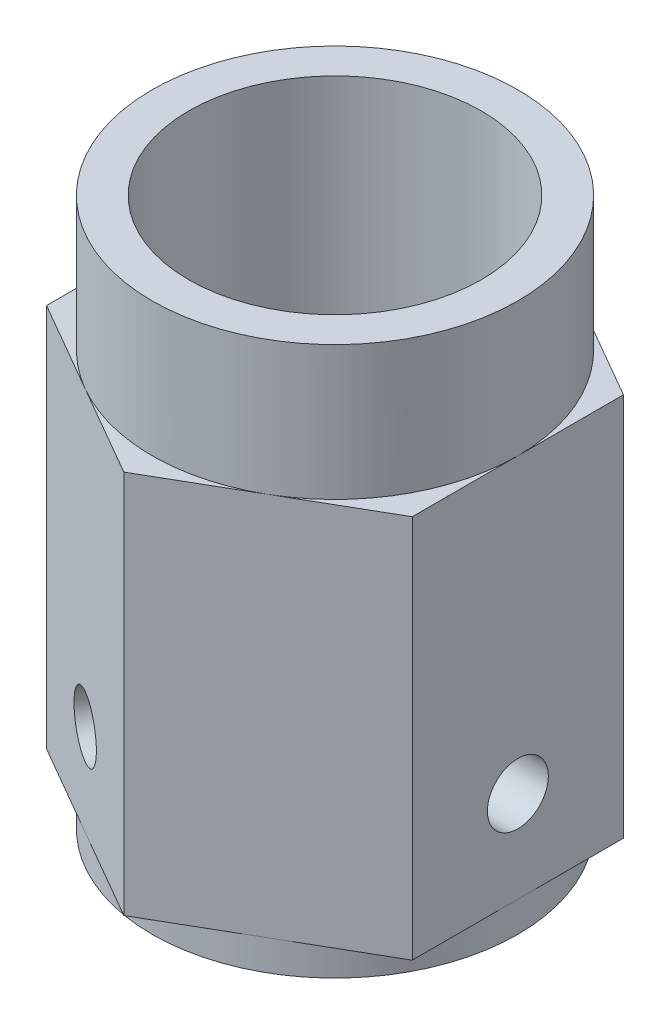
from build123d import *

# Parameters (mm, degrees)
EXTRUDE_1_DEPTH          = 63
SKETCH_2_R               = 30
EXTRUDE_2_DEPTH          = 22
SKETCH_3_R               = 30
EXTRUDE_3_DEPTH          = 5
SKETCH_4_R               = 15
CUT_EXTRUDE_1_DEPTH      = 45
SKETCH_5_R               = 24
CUT_EXTRUDE_2_DEPTH      = 45
CUT_EXTRUDE_3_REACH      = 115.688
CUT_EXTRUDE_3_END_RADIUS = 15
SKETCH_6_R               = 5
CUT_EXTRUDE_4_REACH      = 111.659
CUT_EXTRUDE_4_END_RADIUS = 15
SKETCH_7_R               = 5
CUT_EXTRUDE_5_REACH      = 115.688
CUT_EXTRUDE_5_END_RADIUS = 15
SKETCH_8_R               = 5


with BuildPart() as part:
    # Sketch 1 → Extrude 1 (new body)
    with BuildSketch(Plane(origin=(0, 0, 0), x_dir=(1, 0, 0), z_dir=(0, 1, 0))):
        Polygon((0, 34.641016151), (-30, 17.320508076), (-30, -17.320508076), (0, -34.641016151), (30, -17.320508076), (30, 17.320508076), align=None)
    extrude(amount=EXTRUDE_1_DEPTH)

    # Sketch 2 → Extrude 2 (add)
    with BuildSketch(Plane(origin=(0, 63, 0), x_dir=(1, 0, 0), z_dir=(0, 1, 0))):
        with Locations(Location((0, 0, 0), (0, 0, 60))):
            Circle(SKETCH_2_R)
    extrude(amount=EXTRUDE_2_DEPTH)


with BuildPart() as body_2:
    # Sketch 3 → Extrude 3 (new body)
    with BuildSketch(Plane.XZ):
        with Locations(Location((0, 0, 0), (0, 0, 270))):
            Circle(SKETCH_3_R)
    extrude(amount=EXTRUDE_3_DEPTH)


with BuildPart() as cut_extrude_1_tool:
    # Sketch 4 → Cut-Extrude 1 (new body)
    with BuildSketch(Plane.XZ.offset(5)):
        with Locations(Location((0, 0, 0), (0, 0, 270))):
            Circle(SKETCH_4_R)
    extrude(amount=-CUT_EXTRUDE_1_DEPTH)


with BuildPart() as part_1:
    add(part.part)

    # Cut-Extrude 1: cut by cut_extrude_1_tool
    add(cut_extrude_1_tool.part, mode=Mode.SUBTRACT)

    # Sketch 5 → Cut-Extrude 2 (cut)
    with BuildSketch(Plane(origin=(0, 85, 0), x_dir=(1, 0, 0), z_dir=(0, 1, 0))):
        with Locations(Location((0, 0, 0), (0, 0, 270))):
            Circle(SKETCH_5_R)
    extrude(amount=-CUT_EXTRUDE_2_DEPTH, mode=Mode.SUBTRACT)

    # Cut-Extrude 3: up to this cylinder (the profile starts outside it)
    cut_extrude_3_end = Plane(origin=(0, 15, 0), z_dir=(0, -1, 0)) * Cylinder(CUT_EXTRUDE_3_END_RADIUS, 262.376, mode=Mode.PRIVATE)
    # Sketch 6 → Cut-Extrude 3 (cut, up to the surface)
    with BuildSketch(Plane(origin=(-15, 0, -25.980762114), x_dir=(-0.8660254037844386, 0, 0.5000000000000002), z_dir=(-0.5000000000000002, 0, -0.8660254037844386)), mode=Mode.PRIVATE) as cut_extrude_3_sk1:
        with Locations((0, 15)):
            Circle(SKETCH_6_R)
    cut_extrude_3_tool1 = extrude(cut_extrude_3_sk1.sketch, amount=-CUT_EXTRUDE_3_REACH, mode=Mode.PRIVATE) - cut_extrude_3_end
    add(cut_extrude_3_tool1.solids().sort_by_distance((-15, 15, -25.980762))[0], mode=Mode.SUBTRACT)

    # Cut-Extrude 4: up to this cylinder (the profile starts outside it)
    cut_extrude_4_end = Plane(origin=(0, 15, 0), z_dir=(0, -1, 0)) * Cylinder(CUT_EXTRUDE_4_END_RADIUS, 254.318, mode=Mode.PRIVATE)
    # Sketch 7 → Cut-Extrude 4 (cut, up to the surface)
    with BuildSketch(Plane(origin=(30, 0, 0), x_dir=(0, 0, -1), z_dir=(1, 0, 0)), mode=Mode.PRIVATE) as cut_extrude_4_sk1:
        with Locations((0, 15)):
            Circle(SKETCH_7_R)
    cut_extrude_4_tool1 = extrude(cut_extrude_4_sk1.sketch, amount=-CUT_EXTRUDE_4_REACH, mode=Mode.PRIVATE) - cut_extrude_4_end
    add(cut_extrude_4_tool1.solids().sort_by_distance((30, 15, 0))[0], mode=Mode.SUBTRACT)

    # Cut-Extrude 5: up to this cylinder (the profile starts outside it)
    cut_extrude_5_end = Plane(origin=(0, 15, 0), z_dir=(0, -1, 0)) * Cylinder(CUT_EXTRUDE_5_END_RADIUS, 262.376, mode=Mode.PRIVATE)
    # Sketch 8 → Cut-Extrude 5 (cut, up to the surface)
    with BuildSketch(Plane(origin=(-15, 0, 25.980762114), x_dir=(0.8660254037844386, 0, 0.5000000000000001), z_dir=(-0.5000000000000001, 0, 0.8660254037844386)), mode=Mode.PRIVATE) as cut_extrude_5_sk1:
        with Locations((0, 15)):
            Circle(SKETCH_8_R)
    cut_extrude_5_tool1 = extrude(cut_extrude_5_sk1.sketch, amount=-CUT_EXTRUDE_5_REACH, mode=Mode.PRIVATE) - cut_extrude_5_end
    add(cut_extrude_5_tool1.solids().sort_by_distance((-15, 15, 25.980762))[0], mode=Mode.SUBTRACT)


with BuildPart() as body_2_1:
    add(body_2.part)

    # Cut-Extrude 1: cut by cut_extrude_1_tool
    add(cut_extrude_1_tool.part, mode=Mode.SUBTRACT)


solid = Compound([part_1.part, body_2_1.part])
